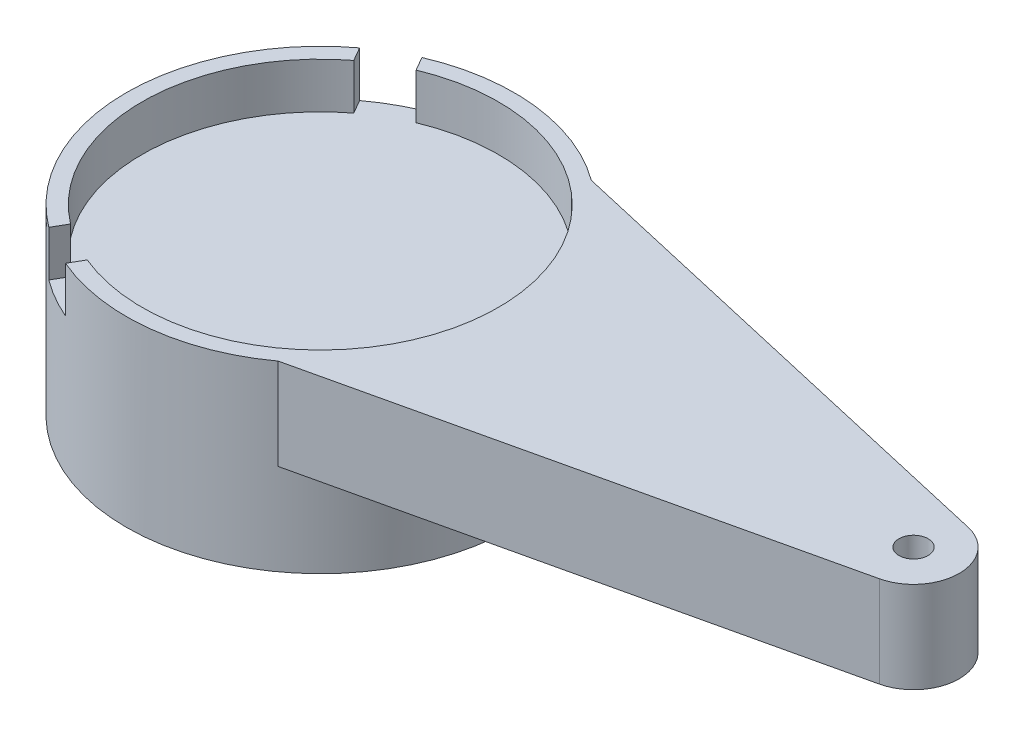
ISO-10303-21;
HEADER;
FILE_DESCRIPTION(('STEP AP214'),'2;1');
FILE_NAME('part.step','',(''),(''),'','','');
FILE_SCHEMA(('AUTOMOTIVE_DESIGN { 1 0 10303 214 1 1 1 1 }'));
ENDSEC;
DATA;
#1=APPLICATION_CONTEXT('core data for automotive mechanical design processes');
#2=APPLICATION_PROTOCOL_DEFINITION('international standard','automotive_design',2000,#1);
#3=PRODUCT_CONTEXT('',#1,'mechanical');
#4=PRODUCT('Part','Part','',(#3));
#5=PRODUCT_RELATED_PRODUCT_CATEGORY('part','',(#4));
#6=PRODUCT_DEFINITION_FORMATION('','',#4);
#7=PRODUCT_DEFINITION_CONTEXT('part definition',#1,'design');
#8=PRODUCT_DEFINITION('design','',#6,#7);
#9=PRODUCT_DEFINITION_SHAPE('','',#8);
#10=(LENGTH_UNIT() NAMED_UNIT(*) SI_UNIT(.MILLI.,.METRE.));
#11=(NAMED_UNIT(*) PLANE_ANGLE_UNIT() SI_UNIT($,.RADIAN.));
#12=(NAMED_UNIT(*) SI_UNIT($,.STERADIAN.) SOLID_ANGLE_UNIT());
#13=UNCERTAINTY_MEASURE_WITH_UNIT(LENGTH_MEASURE(1.E-05),#10,'distance_accuracy_value','');
#14=(GEOMETRIC_REPRESENTATION_CONTEXT(3) GLOBAL_UNCERTAINTY_ASSIGNED_CONTEXT((#13)) GLOBAL_UNIT_ASSIGNED_CONTEXT((#10,
#11,#12)) REPRESENTATION_CONTEXT('',''));
#15=CARTESIAN_POINT('',(0.,0.,0.));
#16=DIRECTION('',(0.,0.,1.));
#17=DIRECTION('',(1.,0.,0.));
#18=AXIS2_PLACEMENT_3D('',#15,#16,#17);
#19=CARTESIAN_POINT('',(0.,5.,0.));
#20=DIRECTION('',(0.,1.,0.));
#21=DIRECTION('',(0.,0.,1.));
#22=AXIS2_PLACEMENT_3D('',#19,#20,#21);
#23=PLANE('',#22);
#24=DIRECTION('',(-0.499999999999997,0.,0.86602540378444));
#25=VECTOR('',#24,1.);
#26=CARTESIAN_POINT('',(-5.92234321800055,5.,7.75779935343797));
#27=LINE('',#26,#25);
#28=CARTESIAN_POINT('',(-5.92234321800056,5.,7.75779935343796));
#29=VERTEX_POINT('',#28);
#30=CARTESIAN_POINT('',(-6.35813894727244,5.,8.51261969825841));
#31=VERTEX_POINT('',#30);
#32=EDGE_CURVE('E225',#29,#31,#27,.T.);
#33=ORIENTED_EDGE('',*,*,#32,.F.);
#34=CARTESIAN_POINT('',(0.,5.,0.));
#35=DIRECTION('',(0.,1.,0.));
#36=DIRECTION('',(0.,0.,1.));
#37=AXIS2_PLACEMENT_3D('',#34,#35,#36);
#38=CIRCLE('',#37,9.75999999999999);
#39=CARTESIAN_POINT('',(-5.92234321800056,5.,-7.75779935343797));
#40=VERTEX_POINT('',#39);
#41=EDGE_CURVE('E206',#40,#29,#38,.T.);
#42=ORIENTED_EDGE('',*,*,#41,.F.);
#43=DIRECTION('',(0.499999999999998,0.,0.866025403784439));
#44=VECTOR('',#43,1.);
#45=CARTESIAN_POINT('',(-6.35813894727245,5.,-8.51261969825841));
#46=LINE('',#45,#44);
#47=CARTESIAN_POINT('',(-6.35813894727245,5.,-8.51261969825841));
#48=VERTEX_POINT('',#47);
#49=EDGE_CURVE('E223',#48,#40,#46,.T.);
#50=ORIENTED_EDGE('',*,*,#49,.F.);
#51=CARTESIAN_POINT('',(0.,5.,0.));
#52=DIRECTION('',(0.,1.,0.));
#53=DIRECTION('',(0.,0.,1.));
#54=AXIS2_PLACEMENT_3D('',#51,#52,#53);
#55=CIRCLE('',#54,10.625);
#56=EDGE_CURVE('E175',#48,#31,#55,.T.);
#57=ORIENTED_EDGE('',*,*,#56,.T.);
#58=EDGE_LOOP('',(#33,#42,#50,#57));
#59=FACE_BOUND('',#58,.T.);
#60=ADVANCED_FACE('F34',(#59),#23,.T.);
#61=CARTESIAN_POINT('',(0.,2.5,0.));
#62=DIRECTION('',(0.,1.,0.));
#63=DIRECTION('',(0.,0.,1.));
#64=AXIS2_PLACEMENT_3D('',#61,#62,#63);
#65=CYLINDRICAL_SURFACE('',#64,9.75999999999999);
#66=ORIENTED_EDGE('',*,*,#41,.T.);
#67=DIRECTION('',(0.,1.,0.));
#68=VECTOR('',#67,1.);
#69=CARTESIAN_POINT('',(-5.92234321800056,-0.783865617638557,7.75779935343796));
#70=LINE('',#69,#68);
#71=CARTESIAN_POINT('',(-5.92234321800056,2.5,7.75779935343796));
#72=VERTEX_POINT('',#71);
#73=EDGE_CURVE('E218',#72,#29,#70,.T.);
#74=ORIENTED_EDGE('',*,*,#73,.F.);
#75=CARTESIAN_POINT('',(0.,2.5,0.));
#76=DIRECTION('',(0.,1.,0.));
#77=DIRECTION('',(0.,0.,1.));
#78=AXIS2_PLACEMENT_3D('',#75,#76,#77);
#79=CIRCLE('',#78,9.75999999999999);
#80=CARTESIAN_POINT('',(-5.92234321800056,2.5,-7.75779935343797));
#81=VERTEX_POINT('',#80);
#82=EDGE_CURVE('E183',#81,#72,#79,.T.);
#83=ORIENTED_EDGE('',*,*,#82,.F.);
#84=DIRECTION('',(0.,1.,0.));
#85=VECTOR('',#84,1.);
#86=CARTESIAN_POINT('',(-5.92234321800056,-0.783865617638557,-7.75779935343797));
#87=LINE('',#86,#85);
#88=EDGE_CURVE('E219',#81,#40,#87,.T.);
#89=ORIENTED_EDGE('',*,*,#88,.T.);
#90=EDGE_LOOP('',(#66,#74,#83,#89));
#91=FACE_BOUND('',#90,.T.);
#92=ADVANCED_FACE('F216',(#91),#65,.F.);
#93=CARTESIAN_POINT('',(0.,5.,0.));
#94=DIRECTION('',(0.,-1.,0.));
#95=DIRECTION('',(0.,0.,-1.));
#96=AXIS2_PLACEMENT_3D('',#93,#94,#95);
#97=CYLINDRICAL_SURFACE('',#96,10.625);
#98=CARTESIAN_POINT('',(0.,2.5,0.));
#99=DIRECTION('',(0.,1.,0.));
#100=DIRECTION('',(0.,0.,1.));
#101=AXIS2_PLACEMENT_3D('',#98,#99,#100);
#102=CIRCLE('',#101,10.625);
#103=CARTESIAN_POINT('',(-4.19307543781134,2.5,9.7626196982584));
#104=VERTEX_POINT('',#103);
#105=CARTESIAN_POINT('',(-6.35813894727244,2.5,8.51261969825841));
#106=VERTEX_POINT('',#105);
#107=EDGE_CURVE('E200',#104,#106,#102,.F.);
#108=ORIENTED_EDGE('',*,*,#107,.T.);
#109=DIRECTION('',(0.,1.,0.));
#110=VECTOR('',#109,1.);
#111=CARTESIAN_POINT('',(-6.35813894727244,-0.783865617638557,8.51261969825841));
#112=LINE('',#111,#110);
#113=EDGE_CURVE('E235',#106,#31,#112,.T.);
#114=ORIENTED_EDGE('',*,*,#113,.T.);
#115=ORIENTED_EDGE('',*,*,#56,.F.);
#116=DIRECTION('',(0.,1.,0.));
#117=VECTOR('',#116,1.);
#118=CARTESIAN_POINT('',(-6.35813894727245,-0.783865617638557,-8.51261969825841));
#119=LINE('',#118,#117);
#120=CARTESIAN_POINT('',(-6.35813894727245,2.5,-8.51261969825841));
#121=VERTEX_POINT('',#120);
#122=EDGE_CURVE('E249',#121,#48,#119,.T.);
#123=ORIENTED_EDGE('',*,*,#122,.F.);
#124=CARTESIAN_POINT('',(0.,2.5,0.));
#125=DIRECTION('',(0.,1.,0.));
#126=DIRECTION('',(0.,0.,1.));
#127=AXIS2_PLACEMENT_3D('',#124,#125,#126);
#128=CIRCLE('',#127,10.625);
#129=CARTESIAN_POINT('',(-4.19307543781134,2.5,-9.76261969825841));
#130=VERTEX_POINT('',#129);
#131=EDGE_CURVE('E242',#121,#130,#128,.F.);
#132=ORIENTED_EDGE('',*,*,#131,.T.);
#133=DIRECTION('',(0.,1.,0.));
#134=VECTOR('',#133,1.);
#135=CARTESIAN_POINT('',(-4.19307543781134,-0.783865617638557,-9.76261969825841));
#136=LINE('',#135,#134);
#137=CARTESIAN_POINT('',(-4.19307543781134,5.,-9.76261969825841));
#138=VERTEX_POINT('',#137);
#139=EDGE_CURVE('E243',#130,#138,#136,.T.);
#140=ORIENTED_EDGE('',*,*,#139,.T.);
#141=CARTESIAN_POINT('',(6.27329198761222,5.,-8.57533863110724));
#142=VERTEX_POINT('',#141);
#143=EDGE_CURVE('E154',#142,#138,#55,.T.);
#144=ORIENTED_EDGE('',*,*,#143,.F.);
#145=DIRECTION('',(0.,-1.,0.));
#146=VECTOR('',#145,1.);
#147=CARTESIAN_POINT('',(6.27329198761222,5.,-8.57533863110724));
#148=LINE('',#147,#146);
#149=CARTESIAN_POINT('',(6.27329198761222,0.,-8.57533863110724));
#150=VERTEX_POINT('',#149);
#151=EDGE_CURVE('E143',#142,#150,#148,.T.);
#152=ORIENTED_EDGE('',*,*,#151,.T.);
#153=CARTESIAN_POINT('',(0.,0.,0.));
#154=DIRECTION('',(0.,1.,0.));
#155=DIRECTION('',(0.,0.,1.));
#156=AXIS2_PLACEMENT_3D('',#153,#154,#155);
#157=CIRCLE('',#156,10.625);
#158=CARTESIAN_POINT('',(6.27329198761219,0.,8.57533863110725));
#159=VERTEX_POINT('',#158);
#160=EDGE_CURVE('E125',#159,#150,#157,.T.);
#161=ORIENTED_EDGE('',*,*,#160,.F.);
#162=DIRECTION('',(0.,-1.,0.));
#163=VECTOR('',#162,1.);
#164=CARTESIAN_POINT('',(6.27329198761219,5.,8.57533863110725));
#165=LINE('',#164,#163);
#166=CARTESIAN_POINT('',(6.27329198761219,5.,8.57533863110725));
#167=VERTEX_POINT('',#166);
#168=EDGE_CURVE('E38',#167,#159,#165,.T.);
#169=ORIENTED_EDGE('',*,*,#168,.F.);
#170=CARTESIAN_POINT('',(-4.19307543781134,5.,9.7626196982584));
#171=VERTEX_POINT('',#170);
#172=EDGE_CURVE('E147',#171,#167,#55,.T.);
#173=ORIENTED_EDGE('',*,*,#172,.F.);
#174=DIRECTION('',(0.,1.,0.));
#175=VECTOR('',#174,1.);
#176=CARTESIAN_POINT('',(-4.19307543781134,-0.783865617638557,9.7626196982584));
#177=LINE('',#176,#175);
#178=EDGE_CURVE('E172',#104,#171,#177,.T.);
#179=ORIENTED_EDGE('',*,*,#178,.F.);
#180=EDGE_LOOP('',(#108,#114,#115,#123,#132,#140,#144,#152,#161,#169,#173,#179));
#181=FACE_BOUND('',#180,.T.);
#182=CARTESIAN_POINT('',(0.,-5.,0.));
#183=DIRECTION('',(0.,1.,0.));
#184=DIRECTION('',(0.,0.,1.));
#185=AXIS2_PLACEMENT_3D('',#182,#183,#184);
#186=CIRCLE('',#185,10.625);
#187=CARTESIAN_POINT('',(0.,-5.,10.625));
#188=VERTEX_POINT('',#187);
#189=EDGE_CURVE('E135',#188,#188,#186,.T.);
#190=ORIENTED_EDGE('',*,*,#189,.T.);
#191=EDGE_LOOP('',(#190));
#192=FACE_BOUND('',#191,.T.);
#193=ADVANCED_FACE('F36',(#181,#192),#97,.T.);
#194=CARTESIAN_POINT('',(33.0584615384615,5.,2.4368259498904));
#195=DIRECTION('',(-0.223384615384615,0.,-0.974730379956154));
#196=DIRECTION('',(-0.974730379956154,0.,0.223384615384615));
#197=AXIS2_PLACEMENT_3D('',#194,#195,#196);
#198=PLANE('',#197);
#199=DIRECTION('',(0.974730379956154,0.,-0.223384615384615));
#200=VECTOR('',#199,1.);
#201=CARTESIAN_POINT('',(33.0584615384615,0.,2.4368259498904));
#202=LINE('',#201,#200);
#203=CARTESIAN_POINT('',(33.0584615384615,0.,2.4368259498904));
#204=VERTEX_POINT('',#203);
#205=EDGE_CURVE('E130',#159,#204,#202,.T.);
#206=ORIENTED_EDGE('',*,*,#205,.T.);
#207=DIRECTION('',(0.,-1.,0.));
#208=VECTOR('',#207,1.);
#209=CARTESIAN_POINT('',(33.0584615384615,5.,2.4368259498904));
#210=LINE('',#209,#208);
#211=CARTESIAN_POINT('',(33.0584615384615,5.,2.4368259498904));
#212=VERTEX_POINT('',#211);
#213=EDGE_CURVE('E157',#212,#204,#210,.T.);
#214=ORIENTED_EDGE('',*,*,#213,.F.);
#215=DIRECTION('',(0.974730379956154,0.,-0.223384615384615));
#216=VECTOR('',#215,1.);
#217=CARTESIAN_POINT('',(33.0584615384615,5.,2.4368259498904));
#218=LINE('',#217,#216);
#219=EDGE_CURVE('E169',#167,#212,#218,.T.);
#220=ORIENTED_EDGE('',*,*,#219,.F.);
#221=ORIENTED_EDGE('',*,*,#168,.T.);
#222=EDGE_LOOP('',(#206,#214,#220,#221));
#223=FACE_BOUND('',#222,.T.);
#224=ADVANCED_FACE('F168',(#223),#198,.F.);
#225=CARTESIAN_POINT('',(32.5,5.,0.));
#226=DIRECTION('',(0.,-1.,0.));
#227=DIRECTION('',(0.,0.,-1.));
#228=AXIS2_PLACEMENT_3D('',#225,#226,#227);
#229=CYLINDRICAL_SURFACE('',#228,2.5);
#230=CARTESIAN_POINT('',(32.5,0.,0.));
#231=DIRECTION('',(0.,1.,0.));
#232=DIRECTION('',(0.,0.,1.));
#233=AXIS2_PLACEMENT_3D('',#230,#231,#232);
#234=CIRCLE('',#233,2.5);
#235=CARTESIAN_POINT('',(33.0584615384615,0.,-2.43682594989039));
#236=VERTEX_POINT('',#235);
#237=EDGE_CURVE('E148',#204,#236,#234,.T.);
#238=ORIENTED_EDGE('',*,*,#237,.T.);
#239=DIRECTION('',(0.,-1.,0.));
#240=VECTOR('',#239,1.);
#241=CARTESIAN_POINT('',(33.0584615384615,5.,-2.43682594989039));
#242=LINE('',#241,#240);
#243=CARTESIAN_POINT('',(33.0584615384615,5.,-2.43682594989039));
#244=VERTEX_POINT('',#243);
#245=EDGE_CURVE('E146',#244,#236,#242,.T.);
#246=ORIENTED_EDGE('',*,*,#245,.F.);
#247=CARTESIAN_POINT('',(32.5,5.,0.));
#248=DIRECTION('',(0.,1.,0.));
#249=DIRECTION('',(0.,0.,1.));
#250=AXIS2_PLACEMENT_3D('',#247,#248,#249);
#251=CIRCLE('',#250,2.5);
#252=EDGE_CURVE('E159',#212,#244,#251,.T.);
#253=ORIENTED_EDGE('',*,*,#252,.F.);
#254=ORIENTED_EDGE('',*,*,#213,.T.);
#255=EDGE_LOOP('',(#238,#246,#253,#254));
#256=FACE_BOUND('',#255,.T.);
#257=ADVANCED_FACE('F184',(#256),#229,.T.);
#258=CARTESIAN_POINT('',(6.27329198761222,5.,-8.57533863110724));
#259=DIRECTION('',(-0.223384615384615,0.,0.974730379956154));
#260=DIRECTION('',(0.974730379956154,0.,0.223384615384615));
#261=AXIS2_PLACEMENT_3D('',#258,#259,#260);
#262=PLANE('',#261);
#263=DIRECTION('',(-0.974730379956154,0.,-0.223384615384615));
#264=VECTOR('',#263,1.);
#265=CARTESIAN_POINT('',(6.27329198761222,0.,-8.57533863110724));
#266=LINE('',#265,#264);
#267=EDGE_CURVE('E129',#236,#150,#266,.T.);
#268=ORIENTED_EDGE('',*,*,#267,.T.);
#269=ORIENTED_EDGE('',*,*,#151,.F.);
#270=DIRECTION('',(-0.974730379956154,0.,-0.223384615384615));
#271=VECTOR('',#270,1.);
#272=CARTESIAN_POINT('',(6.27329198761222,5.,-8.57533863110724));
#273=LINE('',#272,#271);
#274=EDGE_CURVE('E155',#244,#142,#273,.T.);
#275=ORIENTED_EDGE('',*,*,#274,.F.);
#276=ORIENTED_EDGE('',*,*,#245,.T.);
#277=EDGE_LOOP('',(#268,#269,#275,#276));
#278=FACE_BOUND('',#277,.T.);
#279=ADVANCED_FACE('F141',(#278),#262,.F.);
#280=DIRECTION('',(0.499999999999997,0.,-0.86602540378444));
#281=VECTOR('',#280,1.);
#282=CARTESIAN_POINT('',(-3.75727970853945,5.,9.00779935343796));
#283=LINE('',#282,#281);
#284=CARTESIAN_POINT('',(-3.75727970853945,5.,9.00779935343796));
#285=VERTEX_POINT('',#284);
#286=EDGE_CURVE('E188',#171,#285,#283,.T.);
#287=ORIENTED_EDGE('',*,*,#286,.F.);
#288=ORIENTED_EDGE('',*,*,#172,.T.);
#289=ORIENTED_EDGE('',*,*,#219,.T.);
#290=ORIENTED_EDGE('',*,*,#252,.T.);
#291=ORIENTED_EDGE('',*,*,#274,.T.);
#292=ORIENTED_EDGE('',*,*,#143,.T.);
#293=DIRECTION('',(-0.499999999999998,0.,-0.86602540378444));
#294=VECTOR('',#293,1.);
#295=CARTESIAN_POINT('',(-4.19307543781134,5.,-9.76261969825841));
#296=LINE('',#295,#294);
#297=CARTESIAN_POINT('',(-3.75727970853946,5.,-9.00779935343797));
#298=VERTEX_POINT('',#297);
#299=EDGE_CURVE('E247',#298,#138,#296,.T.);
#300=ORIENTED_EDGE('',*,*,#299,.F.);
#301=EDGE_CURVE('E198',#285,#298,#38,.T.);
#302=ORIENTED_EDGE('',*,*,#301,.F.);
#303=EDGE_LOOP('',(#287,#288,#289,#290,#291,#292,#300,#302));
#304=FACE_BOUND('',#303,.T.);
#305=CARTESIAN_POINT('',(32.5,5.,0.));
#306=DIRECTION('',(0.,1.,0.));
#307=DIRECTION('',(0.,0.,1.));
#308=AXIS2_PLACEMENT_3D('',#305,#306,#307);
#309=CIRCLE('',#308,0.800000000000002);
#310=CARTESIAN_POINT('',(32.5,5.,0.800000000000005));
#311=VERTEX_POINT('',#310);
#312=EDGE_CURVE('E193',#311,#311,#309,.T.);
#313=ORIENTED_EDGE('',*,*,#312,.F.);
#314=EDGE_LOOP('',(#313));
#315=FACE_BOUND('',#314,.T.);
#316=ADVANCED_FACE('F185',(#304,#315),#23,.T.);
#317=CARTESIAN_POINT('',(0.,0.,0.));
#318=DIRECTION('',(0.,1.,0.));
#319=DIRECTION('',(0.,0.,1.));
#320=AXIS2_PLACEMENT_3D('',#317,#318,#319);
#321=PLANE('',#320);
#322=CARTESIAN_POINT('',(32.5,0.,0.));
#323=DIRECTION('',(0.,1.,0.));
#324=DIRECTION('',(0.,0.,1.));
#325=AXIS2_PLACEMENT_3D('',#322,#323,#324);
#326=CIRCLE('',#325,0.800000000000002);
#327=CARTESIAN_POINT('',(32.5,0.,0.800000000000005));
#328=VERTEX_POINT('',#327);
#329=EDGE_CURVE('E195',#328,#328,#326,.T.);
#330=ORIENTED_EDGE('',*,*,#329,.T.);
#331=EDGE_LOOP('',(#330));
#332=FACE_BOUND('',#331,.T.);
#333=ORIENTED_EDGE('',*,*,#205,.F.);
#334=ORIENTED_EDGE('',*,*,#160,.T.);
#335=ORIENTED_EDGE('',*,*,#267,.F.);
#336=ORIENTED_EDGE('',*,*,#237,.F.);
#337=EDGE_LOOP('',(#333,#334,#335,#336));
#338=FACE_BOUND('',#337,.T.);
#339=ADVANCED_FACE('F127',(#332,#338),#321,.F.);
#340=CARTESIAN_POINT('',(-3.75727970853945,2.5,9.00779935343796));
#341=VERTEX_POINT('',#340);
#342=CARTESIAN_POINT('',(-3.75727970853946,2.5,-9.00779935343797));
#343=VERTEX_POINT('',#342);
#344=EDGE_CURVE('E205',#341,#343,#79,.T.);
#345=ORIENTED_EDGE('',*,*,#344,.F.);
#346=DIRECTION('',(0.,1.,0.));
#347=VECTOR('',#346,1.);
#348=CARTESIAN_POINT('',(-3.75727970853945,-0.783865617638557,9.00779935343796));
#349=LINE('',#348,#347);
#350=EDGE_CURVE('E230',#341,#285,#349,.T.);
#351=ORIENTED_EDGE('',*,*,#350,.T.);
#352=ORIENTED_EDGE('',*,*,#301,.T.);
#353=DIRECTION('',(0.,1.,0.));
#354=VECTOR('',#353,1.);
#355=CARTESIAN_POINT('',(-3.75727970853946,-0.783865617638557,-9.00779935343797));
#356=LINE('',#355,#354);
#357=EDGE_CURVE('E251',#343,#298,#356,.T.);
#358=ORIENTED_EDGE('',*,*,#357,.F.);
#359=EDGE_LOOP('',(#345,#351,#352,#358));
#360=FACE_BOUND('',#359,.T.);
#361=ADVANCED_FACE('F280',(#360),#65,.F.);
#362=CARTESIAN_POINT('',(0.,2.5,0.));
#363=DIRECTION('',(0.,1.,0.));
#364=DIRECTION('',(0.,0.,1.));
#365=AXIS2_PLACEMENT_3D('',#362,#363,#364);
#366=PLANE('',#365);
#367=ORIENTED_EDGE('',*,*,#344,.T.);
#368=DIRECTION('',(0.499999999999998,0.,0.86602540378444));
#369=VECTOR('',#368,1.);
#370=CARTESIAN_POINT('',(-4.19307543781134,2.5,-9.76261969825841));
#371=LINE('',#370,#369);
#372=EDGE_CURVE('E240',#130,#343,#371,.T.);
#373=ORIENTED_EDGE('',*,*,#372,.F.);
#374=ORIENTED_EDGE('',*,*,#131,.F.);
#375=DIRECTION('',(-0.499999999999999,0.,-0.86602540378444));
#376=VECTOR('',#375,1.);
#377=CARTESIAN_POINT('',(-6.35813894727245,2.5,-8.51261969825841));
#378=LINE('',#377,#376);
#379=EDGE_CURVE('E57',#81,#121,#378,.T.);
#380=ORIENTED_EDGE('',*,*,#379,.F.);
#381=ORIENTED_EDGE('',*,*,#82,.T.);
#382=DIRECTION('',(0.499999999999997,0.,-0.86602540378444));
#383=VECTOR('',#382,1.);
#384=CARTESIAN_POINT('',(-5.92234321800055,2.5,7.75779935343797));
#385=LINE('',#384,#383);
#386=EDGE_CURVE('E237',#106,#72,#385,.T.);
#387=ORIENTED_EDGE('',*,*,#386,.F.);
#388=ORIENTED_EDGE('',*,*,#107,.F.);
#389=DIRECTION('',(-0.499999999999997,0.,0.86602540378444));
#390=VECTOR('',#389,1.);
#391=CARTESIAN_POINT('',(-3.75727970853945,2.5,9.00779935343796));
#392=LINE('',#391,#390);
#393=EDGE_CURVE('E50',#341,#104,#392,.T.);
#394=ORIENTED_EDGE('',*,*,#393,.F.);
#395=EDGE_LOOP('',(#367,#373,#374,#380,#381,#387,#388,#394));
#396=FACE_BOUND('',#395,.T.);
#397=ADVANCED_FACE('F289',(#396),#366,.T.);
#398=CARTESIAN_POINT('',(32.5,5.,0.));
#399=DIRECTION('',(0.,1.,0.));
#400=DIRECTION('',(0.,0.,1.));
#401=AXIS2_PLACEMENT_3D('',#398,#399,#400);
#402=CYLINDRICAL_SURFACE('',#401,0.800000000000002);
#403=ORIENTED_EDGE('',*,*,#329,.F.);
#404=EDGE_LOOP('',(#403));
#405=FACE_BOUND('',#404,.T.);
#406=ORIENTED_EDGE('',*,*,#312,.T.);
#407=EDGE_LOOP('',(#406));
#408=FACE_BOUND('',#407,.T.);
#409=ADVANCED_FACE('F292',(#405,#408),#402,.F.);
#410=CARTESIAN_POINT('',(-4.19307543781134,-0.783865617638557,-9.76261969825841));
#411=DIRECTION('',(0.86602540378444,0.,-0.499999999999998));
#412=DIRECTION('',(-0.499999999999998,0.,-0.86602540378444));
#413=AXIS2_PLACEMENT_3D('',#410,#411,#412);
#414=PLANE('',#413);
#415=ORIENTED_EDGE('',*,*,#372,.T.);
#416=ORIENTED_EDGE('',*,*,#357,.T.);
#417=ORIENTED_EDGE('',*,*,#299,.T.);
#418=ORIENTED_EDGE('',*,*,#139,.F.);
#419=EDGE_LOOP('',(#415,#416,#417,#418));
#420=FACE_BOUND('',#419,.T.);
#421=ADVANCED_FACE('F295',(#420),#414,.F.);
#422=CARTESIAN_POINT('',(-6.35813894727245,-0.783865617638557,-8.51261969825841));
#423=DIRECTION('',(-0.866025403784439,0.,0.499999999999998));
#424=DIRECTION('',(0.499999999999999,0.,0.86602540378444));
#425=AXIS2_PLACEMENT_3D('',#422,#423,#424);
#426=PLANE('',#425);
#427=ORIENTED_EDGE('',*,*,#379,.T.);
#428=ORIENTED_EDGE('',*,*,#122,.T.);
#429=ORIENTED_EDGE('',*,*,#49,.T.);
#430=ORIENTED_EDGE('',*,*,#88,.F.);
#431=EDGE_LOOP('',(#427,#428,#429,#430));
#432=FACE_BOUND('',#431,.T.);
#433=ADVANCED_FACE('F255',(#432),#426,.F.);
#434=CARTESIAN_POINT('',(-5.92234321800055,-0.783865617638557,7.75779935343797));
#435=DIRECTION('',(-0.86602540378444,0.,-0.499999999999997));
#436=DIRECTION('',(-0.499999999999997,0.,0.86602540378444));
#437=AXIS2_PLACEMENT_3D('',#434,#435,#436);
#438=PLANE('',#437);
#439=ORIENTED_EDGE('',*,*,#386,.T.);
#440=ORIENTED_EDGE('',*,*,#73,.T.);
#441=ORIENTED_EDGE('',*,*,#32,.T.);
#442=ORIENTED_EDGE('',*,*,#113,.F.);
#443=EDGE_LOOP('',(#439,#440,#441,#442));
#444=FACE_BOUND('',#443,.T.);
#445=ADVANCED_FACE('F256',(#444),#438,.F.);
#446=CARTESIAN_POINT('',(-3.75727970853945,-0.783865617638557,9.00779935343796));
#447=DIRECTION('',(0.86602540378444,0.,0.499999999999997));
#448=DIRECTION('',(0.499999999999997,0.,-0.86602540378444));
#449=AXIS2_PLACEMENT_3D('',#446,#447,#448);
#450=PLANE('',#449);
#451=ORIENTED_EDGE('',*,*,#393,.T.);
#452=ORIENTED_EDGE('',*,*,#178,.T.);
#453=ORIENTED_EDGE('',*,*,#286,.T.);
#454=ORIENTED_EDGE('',*,*,#350,.F.);
#455=EDGE_LOOP('',(#451,#452,#453,#454));
#456=FACE_BOUND('',#455,.T.);
#457=ADVANCED_FACE('F302',(#456),#450,.F.);
#458=CARTESIAN_POINT('',(0.,-5.,0.));
#459=DIRECTION('',(0.,1.,0.));
#460=DIRECTION('',(0.,0.,1.));
#461=AXIS2_PLACEMENT_3D('',#458,#459,#460);
#462=PLANE('',#461);
#463=CARTESIAN_POINT('',(0.,-5.,0.));
#464=DIRECTION('',(0.,1.,0.));
#465=DIRECTION('',(0.,0.,1.));
#466=AXIS2_PLACEMENT_3D('',#463,#464,#465);
#467=CIRCLE('',#466,6.5);
#468=CARTESIAN_POINT('',(0.,-5.,6.5));
#469=VERTEX_POINT('',#468);
#470=EDGE_CURVE('E136',#469,#469,#467,.T.);
#471=ORIENTED_EDGE('',*,*,#470,.T.);
#472=EDGE_LOOP('',(#471));
#473=FACE_BOUND('',#472,.T.);
#474=ORIENTED_EDGE('',*,*,#189,.F.);
#475=EDGE_LOOP('',(#474));
#476=FACE_BOUND('',#475,.T.);
#477=ADVANCED_FACE('F264',(#473,#476),#462,.F.);
#478=CARTESIAN_POINT('',(0.,-5.,0.));
#479=DIRECTION('',(0.,1.,0.));
#480=DIRECTION('',(0.,0.,1.));
#481=AXIS2_PLACEMENT_3D('',#478,#479,#480);
#482=CYLINDRICAL_SURFACE('',#481,6.5);
#483=ORIENTED_EDGE('',*,*,#470,.F.);
#484=EDGE_LOOP('',(#483));
#485=FACE_BOUND('',#484,.T.);
#486=CARTESIAN_POINT('',(0.,0.,0.));
#487=DIRECTION('',(0.,1.,0.));
#488=DIRECTION('',(0.,0.,1.));
#489=AXIS2_PLACEMENT_3D('',#486,#487,#488);
#490=CIRCLE('',#489,6.5);
#491=CARTESIAN_POINT('',(0.,0.,6.5));
#492=VERTEX_POINT('',#491);
#493=EDGE_CURVE('E11',#492,#492,#490,.T.);
#494=ORIENTED_EDGE('',*,*,#493,.T.);
#495=EDGE_LOOP('',(#494));
#496=FACE_BOUND('',#495,.T.);
#497=ADVANCED_FACE('F267',(#485,#496),#482,.F.);
#498=ORIENTED_EDGE('',*,*,#493,.F.);
#499=EDGE_LOOP('',(#498));
#500=FACE_BOUND('',#499,.T.);
#501=ADVANCED_FACE('F270',(#500),#321,.F.);
#502=CLOSED_SHELL('',(#60,#92,#193,#224,#257,#279,#316,#339,#361,#397,#409,#421,#433,#445,#457,
#477,#497,#501));
#503=MANIFOLD_SOLID_BREP('B2',#502);
#504=ADVANCED_BREP_SHAPE_REPRESENTATION('',(#18,#503),#14);
#505=SHAPE_DEFINITION_REPRESENTATION(#9,#504);
ENDSEC;
END-ISO-10303-21;
